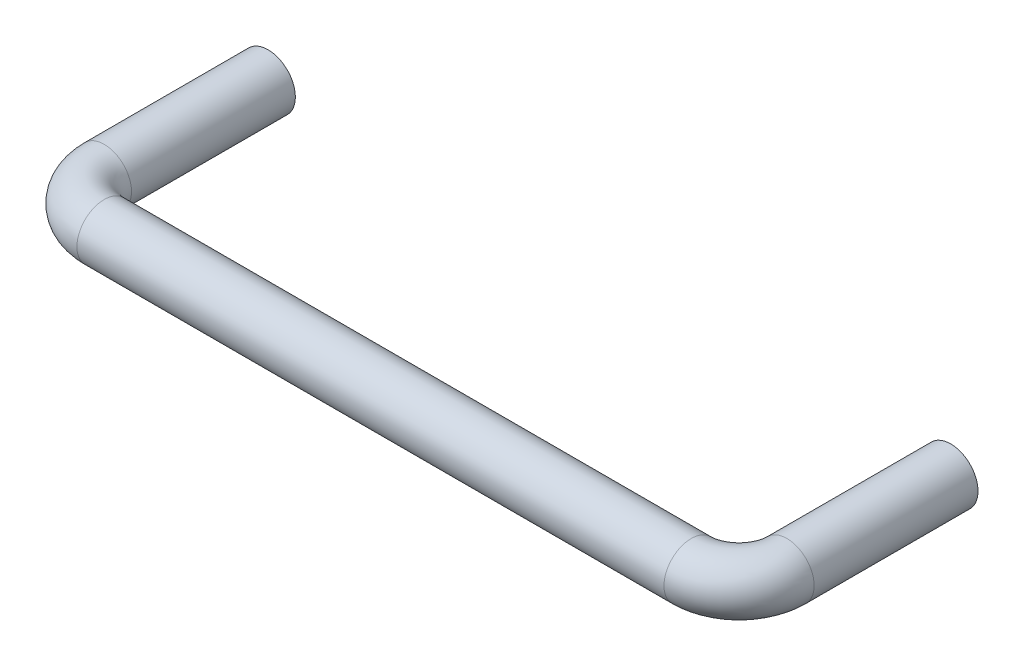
ISO-10303-21;
HEADER;
FILE_DESCRIPTION(('STEP AP214'),'2;1');
FILE_NAME('part.step','',(''),(''),'','','');
FILE_SCHEMA(('AUTOMOTIVE_DESIGN { 1 0 10303 214 1 1 1 1 }'));
ENDSEC;
DATA;
#1=APPLICATION_CONTEXT('core data for automotive mechanical design processes');
#2=APPLICATION_PROTOCOL_DEFINITION('international standard','automotive_design',2000,#1);
#3=PRODUCT_CONTEXT('',#1,'mechanical');
#4=PRODUCT('Part','Part','',(#3));
#5=PRODUCT_RELATED_PRODUCT_CATEGORY('part','',(#4));
#6=PRODUCT_DEFINITION_FORMATION('','',#4);
#7=PRODUCT_DEFINITION_CONTEXT('part definition',#1,'design');
#8=PRODUCT_DEFINITION('design','',#6,#7);
#9=PRODUCT_DEFINITION_SHAPE('','',#8);
#10=(LENGTH_UNIT() NAMED_UNIT(*) SI_UNIT(.MILLI.,.METRE.));
#11=(NAMED_UNIT(*) PLANE_ANGLE_UNIT() SI_UNIT($,.RADIAN.));
#12=(NAMED_UNIT(*) SI_UNIT($,.STERADIAN.) SOLID_ANGLE_UNIT());
#13=UNCERTAINTY_MEASURE_WITH_UNIT(LENGTH_MEASURE(1.E-05),#10,'distance_accuracy_value','');
#14=(GEOMETRIC_REPRESENTATION_CONTEXT(3) GLOBAL_UNCERTAINTY_ASSIGNED_CONTEXT((#13)) GLOBAL_UNIT_ASSIGNED_CONTEXT((#10,
#11,#12)) REPRESENTATION_CONTEXT('',''));
#15=CARTESIAN_POINT('',(0.,0.,0.));
#16=DIRECTION('',(0.,0.,1.));
#17=DIRECTION('',(1.,0.,0.));
#18=AXIS2_PLACEMENT_3D('',#15,#16,#17);
#19=CARTESIAN_POINT('',(0.,0.,0.));
#20=DIRECTION('',(0.,0.,-1.));
#21=DIRECTION('',(1.,0.,0.));
#22=AXIS2_PLACEMENT_3D('',#19,#20,#21);
#23=PLANE('',#22);
#24=CARTESIAN_POINT('',(0.,0.,0.));
#25=DIRECTION('',(0.,0.,-1.));
#26=DIRECTION('',(-1.,0.,0.));
#27=AXIS2_PLACEMENT_3D('',#24,#25,#26);
#28=CIRCLE('',#27,2.94999999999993);
#29=CARTESIAN_POINT('',(-2.94999999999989,0.,0.));
#30=VERTEX_POINT('',#29);
#31=EDGE_CURVE('E8',#30,#30,#28,.F.);
#32=ORIENTED_EDGE('',*,*,#31,.T.);
#33=EDGE_LOOP('',(#32));
#34=FACE_BOUND('',#33,.T.);
#35=CARTESIAN_POINT('',(0.,0.,0.));
#36=DIRECTION('',(0.,0.,-1.));
#37=DIRECTION('',(1.,0.,0.));
#38=AXIS2_PLACEMENT_3D('',#35,#36,#37);
#39=CIRCLE('',#38,4.);
#40=CARTESIAN_POINT('',(4.,0.,0.));
#41=VERTEX_POINT('',#40);
#42=EDGE_CURVE('E47',#41,#41,#39,.T.);
#43=ORIENTED_EDGE('',*,*,#42,.T.);
#44=EDGE_LOOP('',(#43));
#45=FACE_BOUND('',#44,.T.);
#46=ADVANCED_FACE('F12',(#34,#45),#23,.T.);
#47=CARTESIAN_POINT('',(100.,0.,23.9999999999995));
#48=DIRECTION('',(0.,0.,-1.));
#49=DIRECTION('',(0.,1.,0.));
#50=AXIS2_PLACEMENT_3D('',#47,#48,#49);
#51=CYLINDRICAL_SURFACE('',#50,4.);
#52=CARTESIAN_POINT('',(100.,0.,-2.08166817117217E-13));
#53=DIRECTION('',(0.,0.,1.));
#54=DIRECTION('',(-1.,0.,0.));
#55=AXIS2_PLACEMENT_3D('',#52,#53,#54);
#56=CIRCLE('',#55,4.);
#57=CARTESIAN_POINT('',(96.,0.,-1.92669448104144E-13));
#58=VERTEX_POINT('',#57);
#59=EDGE_CURVE('E32',#58,#58,#56,.T.);
#60=ORIENTED_EDGE('',*,*,#59,.T.);
#61=EDGE_LOOP('',(#60));
#62=FACE_BOUND('',#61,.T.);
#63=CARTESIAN_POINT('',(100.,0.,23.9999999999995));
#64=DIRECTION('',(0.,0.,1.));
#65=DIRECTION('',(-1.,0.,0.));
#66=AXIS2_PLACEMENT_3D('',#63,#64,#65);
#67=CIRCLE('',#66,4.);
#68=CARTESIAN_POINT('',(104.,0.,23.9999999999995));
#69=VERTEX_POINT('',#68);
#70=EDGE_CURVE('E35',#69,#69,#67,.T.);
#71=ORIENTED_EDGE('',*,*,#70,.F.);
#72=EDGE_LOOP('',(#71));
#73=FACE_BOUND('',#72,.T.);
#74=ADVANCED_FACE('F81',(#62,#73),#51,.T.);
#75=CARTESIAN_POINT('',(93.,0.,23.9999999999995));
#76=DIRECTION('',(0.,1.,0.));
#77=DIRECTION('',(-1.,0.,0.));
#78=AXIS2_PLACEMENT_3D('',#75,#76,#77);
#79=TOROIDAL_SURFACE('',#78,7.,4.);
#80=CARTESIAN_POINT('',(93.,0.,30.9999999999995));
#81=DIRECTION('',(-1.,0.,0.));
#82=DIRECTION('',(0.,0.,-1.));
#83=AXIS2_PLACEMENT_3D('',#80,#81,#82);
#84=CIRCLE('',#83,4.);
#85=CARTESIAN_POINT('',(93.,0.,34.9999999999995));
#86=VERTEX_POINT('',#85);
#87=EDGE_CURVE('E38',#86,#86,#84,.T.);
#88=CARTESIAN_POINT('',(93.,0.,23.9999999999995));
#89=DIRECTION('',(0.,1.,0.));
#90=DIRECTION('',(-1.,0.,0.));
#91=AXIS2_PLACEMENT_3D('',#88,#89,#90);
#92=CIRCLE('',#91,11.);
#93=EDGE_CURVE('',#86,#69,#92,.T.);
#94=ORIENTED_EDGE('',*,*,#87,.F.);
#95=ORIENTED_EDGE('',*,*,#70,.T.);
#96=ORIENTED_EDGE('',*,*,#93,.T.);
#97=ORIENTED_EDGE('',*,*,#93,.F.);
#98=EDGE_LOOP('',(#94,#96,#95,#97));
#99=FACE_BOUND('',#98,.T.);
#100=ADVANCED_FACE('F87',(#99),#79,.T.);
#101=CARTESIAN_POINT('',(7.,0.,31.));
#102=DIRECTION('',(1.,0.,0.));
#103=DIRECTION('',(0.,0.,1.));
#104=AXIS2_PLACEMENT_3D('',#101,#102,#103);
#105=CYLINDRICAL_SURFACE('',#104,4.);
#106=CARTESIAN_POINT('',(7.,0.,31.));
#107=DIRECTION('',(-1.,0.,0.));
#108=DIRECTION('',(0.,0.,-1.));
#109=AXIS2_PLACEMENT_3D('',#106,#107,#108);
#110=CIRCLE('',#109,4.);
#111=CARTESIAN_POINT('',(7.,0.,35.));
#112=VERTEX_POINT('',#111);
#113=EDGE_CURVE('E41',#112,#112,#110,.T.);
#114=ORIENTED_EDGE('',*,*,#113,.F.);
#115=EDGE_LOOP('',(#114));
#116=FACE_BOUND('',#115,.T.);
#117=ORIENTED_EDGE('',*,*,#87,.T.);
#118=EDGE_LOOP('',(#117));
#119=FACE_BOUND('',#118,.T.);
#120=ADVANCED_FACE('F95',(#116,#119),#105,.T.);
#121=CARTESIAN_POINT('',(7.,0.,24.));
#122=DIRECTION('',(0.,1.,0.));
#123=DIRECTION('',(-1.,0.,0.));
#124=AXIS2_PLACEMENT_3D('',#121,#122,#123);
#125=TOROIDAL_SURFACE('',#124,7.,4.);
#126=CARTESIAN_POINT('',(0.,0.,24.));
#127=DIRECTION('',(0.,0.,-1.));
#128=DIRECTION('',(1.,0.,0.));
#129=AXIS2_PLACEMENT_3D('',#126,#127,#128);
#130=CIRCLE('',#129,4.);
#131=CARTESIAN_POINT('',(-4.,0.,24.));
#132=VERTEX_POINT('',#131);
#133=EDGE_CURVE('E44',#132,#132,#130,.T.);
#134=CARTESIAN_POINT('',(7.,0.,24.));
#135=DIRECTION('',(0.,1.,0.));
#136=DIRECTION('',(-1.,0.,0.));
#137=AXIS2_PLACEMENT_3D('',#134,#135,#136);
#138=CIRCLE('',#137,11.);
#139=EDGE_CURVE('',#132,#112,#138,.T.);
#140=ORIENTED_EDGE('',*,*,#133,.F.);
#141=ORIENTED_EDGE('',*,*,#113,.T.);
#142=ORIENTED_EDGE('',*,*,#139,.T.);
#143=ORIENTED_EDGE('',*,*,#139,.F.);
#144=EDGE_LOOP('',(#140,#142,#141,#143));
#145=FACE_BOUND('',#144,.T.);
#146=ADVANCED_FACE('F75',(#145),#125,.T.);
#147=CARTESIAN_POINT('',(0.,0.,24.));
#148=DIRECTION('',(0.,0.,-1.));
#149=DIRECTION('',(1.,0.,0.));
#150=AXIS2_PLACEMENT_3D('',#147,#148,#149);
#151=CYLINDRICAL_SURFACE('',#150,4.);
#152=ORIENTED_EDGE('',*,*,#42,.F.);
#153=EDGE_LOOP('',(#152));
#154=FACE_BOUND('',#153,.T.);
#155=ORIENTED_EDGE('',*,*,#133,.T.);
#156=EDGE_LOOP('',(#155));
#157=FACE_BOUND('',#156,.T.);
#158=ADVANCED_FACE('F63',(#154,#157),#151,.T.);
#159=CARTESIAN_POINT('',(100.,0.,-2.08166817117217E-13));
#160=DIRECTION('',(0.,0.,1.));
#161=DIRECTION('',(-1.,0.,0.));
#162=AXIS2_PLACEMENT_3D('',#159,#160,#161);
#163=PLANE('',#162);
#164=CARTESIAN_POINT('',(100.,0.,-2.08166817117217E-13));
#165=DIRECTION('',(0.,0.,1.));
#166=DIRECTION('',(1.,0.,0.));
#167=AXIS2_PLACEMENT_3D('',#164,#165,#166);
#168=CIRCLE('',#167,2.94999999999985);
#169=CARTESIAN_POINT('',(102.95,0.,-2.19596126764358E-13));
#170=VERTEX_POINT('',#169);
#171=EDGE_CURVE('E23',#170,#170,#168,.T.);
#172=ORIENTED_EDGE('',*,*,#171,.T.);
#173=EDGE_LOOP('',(#172));
#174=FACE_BOUND('',#173,.T.);
#175=ORIENTED_EDGE('',*,*,#59,.F.);
#176=EDGE_LOOP('',(#175));
#177=FACE_BOUND('',#176,.T.);
#178=ADVANCED_FACE('F61',(#174,#177),#163,.F.);
#179=CARTESIAN_POINT('',(100.,0.,10.));
#180=DIRECTION('',(0.,0.,1.));
#181=DIRECTION('',(0.,-1.,0.));
#182=AXIS2_PLACEMENT_3D('',#179,#180,#181);
#183=PLANE('',#182);
#184=CARTESIAN_POINT('',(100.,0.,10.));
#185=DIRECTION('',(0.,0.,1.));
#186=DIRECTION('',(0.,-1.,0.));
#187=AXIS2_PLACEMENT_3D('',#184,#185,#186);
#188=CIRCLE('',#187,2.50000000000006);
#189=CARTESIAN_POINT('',(100.,-2.50000000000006,10.));
#190=VERTEX_POINT('',#189);
#191=EDGE_CURVE('E53',#190,#190,#188,.T.);
#192=ORIENTED_EDGE('',*,*,#191,.F.);
#193=EDGE_LOOP('',(#192));
#194=FACE_BOUND('',#193,.T.);
#195=ADVANCED_FACE('F59',(#194),#183,.F.);
#196=CARTESIAN_POINT('',(100.,0.,13.3120136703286));
#197=DIRECTION('',(0.,0.,1.));
#198=DIRECTION('',(0.,-1.,0.));
#199=AXIS2_PLACEMENT_3D('',#196,#197,#198);
#200=CYLINDRICAL_SURFACE('',#199,2.50000000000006);
#201=CARTESIAN_POINT('',(100.,0.,0.449999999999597));
#202=DIRECTION('',(0.,0.,1.));
#203=DIRECTION('',(1.,0.,0.));
#204=AXIS2_PLACEMENT_3D('',#201,#202,#203);
#205=CIRCLE('',#204,2.50000000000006);
#206=CARTESIAN_POINT('',(102.5,0.,0.449999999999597));
#207=VERTEX_POINT('',#206);
#208=EDGE_CURVE('E27',#207,#207,#205,.F.);
#209=ORIENTED_EDGE('',*,*,#208,.T.);
#210=EDGE_LOOP('',(#209));
#211=FACE_BOUND('',#210,.T.);
#212=ORIENTED_EDGE('',*,*,#191,.T.);
#213=EDGE_LOOP('',(#212));
#214=FACE_BOUND('',#213,.T.);
#215=ADVANCED_FACE('F57',(#211,#214),#200,.F.);
#216=CARTESIAN_POINT('',(-2.49999999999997,0.,10.));
#217=DIRECTION('',(0.,0.,-1.));
#218=DIRECTION('',(1.,0.,0.));
#219=AXIS2_PLACEMENT_3D('',#216,#217,#218);
#220=PLANE('',#219);
#221=CARTESIAN_POINT('',(0.,0.,10.));
#222=DIRECTION('',(0.,0.,1.));
#223=DIRECTION('',(-1.,0.,0.));
#224=AXIS2_PLACEMENT_3D('',#221,#222,#223);
#225=CIRCLE('',#224,2.5);
#226=CARTESIAN_POINT('',(-2.49999999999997,0.,10.));
#227=VERTEX_POINT('',#226);
#228=EDGE_CURVE('E50',#227,#227,#225,.T.);
#229=ORIENTED_EDGE('',*,*,#228,.F.);
#230=EDGE_LOOP('',(#229));
#231=FACE_BOUND('',#230,.T.);
#232=ADVANCED_FACE('F70',(#231),#220,.T.);
#233=CARTESIAN_POINT('',(0.,0.,32.4805950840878));
#234=DIRECTION('',(0.,0.,1.));
#235=DIRECTION('',(-1.,0.,0.));
#236=AXIS2_PLACEMENT_3D('',#233,#234,#235);
#237=CYLINDRICAL_SURFACE('',#236,2.5);
#238=CARTESIAN_POINT('',(0.,0.,0.449999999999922));
#239=DIRECTION('',(0.,0.,-1.));
#240=DIRECTION('',(-1.,0.,0.));
#241=AXIS2_PLACEMENT_3D('',#238,#239,#240);
#242=CIRCLE('',#241,2.5);
#243=CARTESIAN_POINT('',(-2.49999999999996,0.,0.449999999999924));
#244=VERTEX_POINT('',#243);
#245=EDGE_CURVE('E19',#244,#244,#242,.T.);
#246=ORIENTED_EDGE('',*,*,#245,.T.);
#247=EDGE_LOOP('',(#246));
#248=FACE_BOUND('',#247,.T.);
#249=ORIENTED_EDGE('',*,*,#228,.T.);
#250=EDGE_LOOP('',(#249));
#251=FACE_BOUND('',#250,.T.);
#252=ADVANCED_FACE('F104',(#248,#251),#237,.F.);
#253=CARTESIAN_POINT('',(100.,0.,0.449999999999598));
#254=DIRECTION('',(0.,0.,-1.));
#255=DIRECTION('',(-1.,0.,0.));
#256=AXIS2_PLACEMENT_3D('',#253,#254,#255);
#257=CONICAL_SURFACE('',#256,2.50000000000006,0.785398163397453);
#258=ORIENTED_EDGE('',*,*,#171,.F.);
#259=EDGE_LOOP('',(#258));
#260=FACE_BOUND('',#259,.T.);
#261=ORIENTED_EDGE('',*,*,#208,.F.);
#262=EDGE_LOOP('',(#261));
#263=FACE_BOUND('',#262,.T.);
#264=ADVANCED_FACE('F102',(#260,#263),#257,.F.);
#265=CARTESIAN_POINT('',(0.,0.,0.449999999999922));
#266=DIRECTION('',(0.,0.,-1.));
#267=DIRECTION('',(-1.,0.,0.));
#268=AXIS2_PLACEMENT_3D('',#265,#266,#267);
#269=CONICAL_SURFACE('',#268,2.5,0.785398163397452);
#270=ORIENTED_EDGE('',*,*,#31,.F.);
#271=EDGE_LOOP('',(#270));
#272=FACE_BOUND('',#271,.T.);
#273=ORIENTED_EDGE('',*,*,#245,.F.);
#274=EDGE_LOOP('',(#273));
#275=FACE_BOUND('',#274,.T.);
#276=ADVANCED_FACE('F14',(#272,#275),#269,.F.);
#277=CLOSED_SHELL('',(#46,#74,#100,#120,#146,#158,#178,#195,#215,#232,#252,#264,#276));
#278=MANIFOLD_SOLID_BREP('B1',#277);
#279=ADVANCED_BREP_SHAPE_REPRESENTATION('',(#18,#278),#14);
#280=SHAPE_DEFINITION_REPRESENTATION(#9,#279);
ENDSEC;
END-ISO-10303-21;
